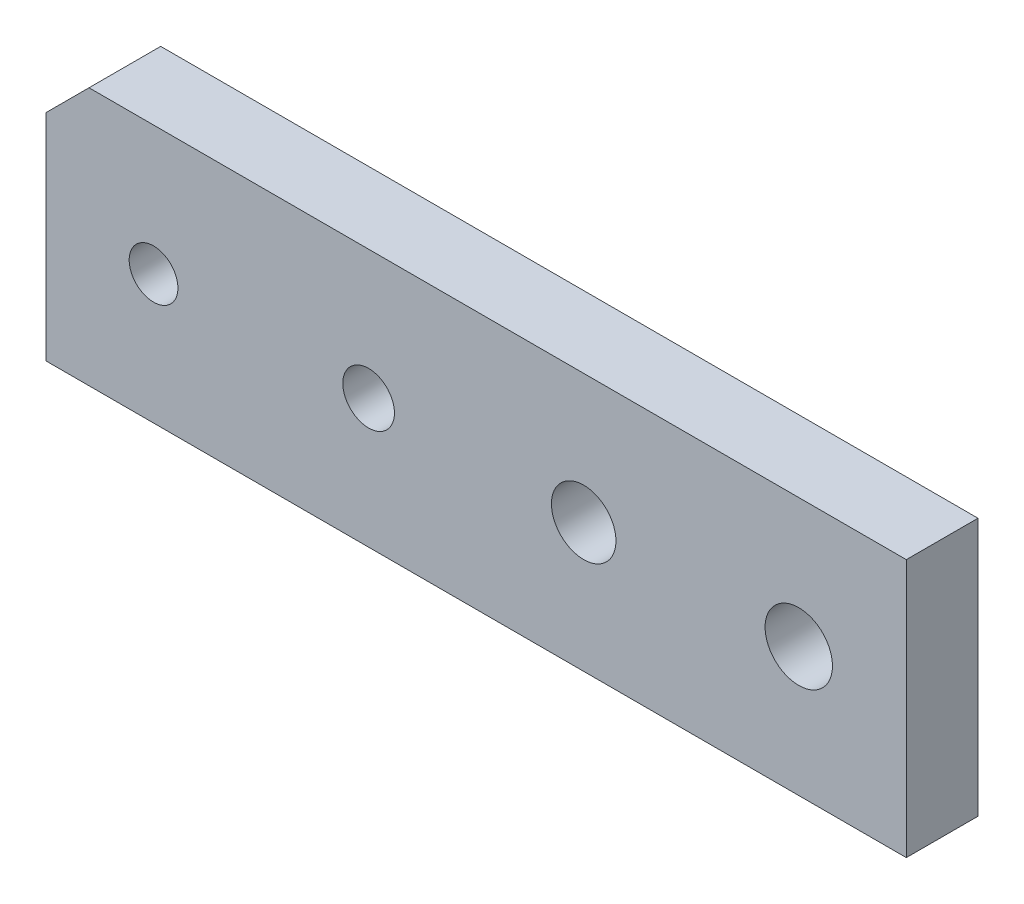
from build123d import *

# Parameters (mm, degrees)
SKETCH_1_R                  = 1.7
SKETCH_1_R_2                = 1.8
SKETCH_1_R_3                = 2.25
SKETCH_1_R_4                = 2.35
FOUR_CLEARANCE_TRIALS_DEPTH = 5


with BuildPart() as part:
    # Sketch 1 → Four_clearance_trials (new body)
    with BuildSketch(Plane.XY):
        Polygon((-30, -9), (30, -9), (30, 9), (-27, 9), (-30, 6), align=None)
        with Locations((-22.5, 0)):
            Circle(SKETCH_1_R, mode=Mode.SUBTRACT)
        with Locations((-7.5, 0)):
            Circle(SKETCH_1_R_2, mode=Mode.SUBTRACT)
        with Locations((7.5, 0)):
            Circle(SKETCH_1_R_3, mode=Mode.SUBTRACT)
        with Locations((22.5, 0)):
            Circle(SKETCH_1_R_4, mode=Mode.SUBTRACT)
    extrude(amount=FOUR_CLEARANCE_TRIALS_DEPTH)


solid = part.part
